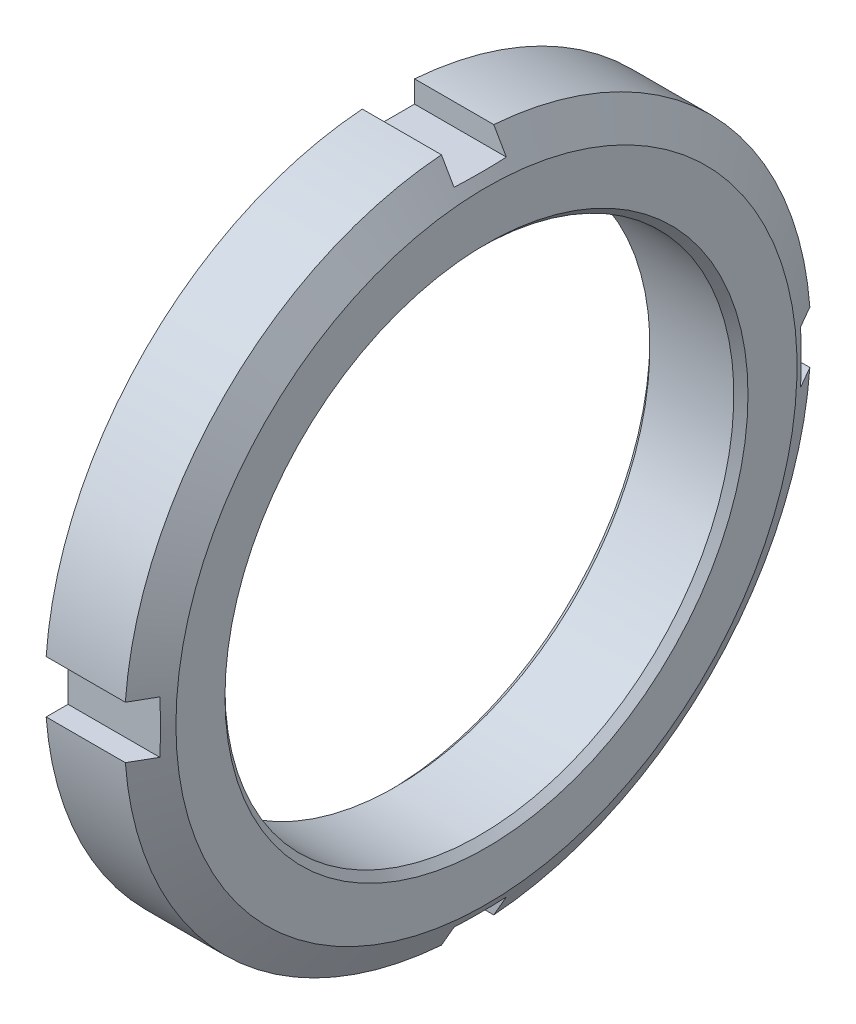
ISO-10303-21;
HEADER;
FILE_DESCRIPTION(('STEP AP214'),'2;1');
FILE_NAME('part.step','',(''),(''),'','','');
FILE_SCHEMA(('AUTOMOTIVE_DESIGN { 1 0 10303 214 1 1 1 1 }'));
ENDSEC;
DATA;
#1=APPLICATION_CONTEXT('core data for automotive mechanical design processes');
#2=APPLICATION_PROTOCOL_DEFINITION('international standard','automotive_design',2000,#1);
#3=PRODUCT_CONTEXT('',#1,'mechanical');
#4=PRODUCT('Part','Part','',(#3));
#5=PRODUCT_RELATED_PRODUCT_CATEGORY('part','',(#4));
#6=PRODUCT_DEFINITION_FORMATION('','',#4);
#7=PRODUCT_DEFINITION_CONTEXT('part definition',#1,'design');
#8=PRODUCT_DEFINITION('design','',#6,#7);
#9=PRODUCT_DEFINITION_SHAPE('','',#8);
#10=(LENGTH_UNIT() NAMED_UNIT(*) SI_UNIT(.MILLI.,.METRE.));
#11=(NAMED_UNIT(*) PLANE_ANGLE_UNIT() SI_UNIT($,.RADIAN.));
#12=(NAMED_UNIT(*) SI_UNIT($,.STERADIAN.) SOLID_ANGLE_UNIT());
#13=UNCERTAINTY_MEASURE_WITH_UNIT(LENGTH_MEASURE(1.E-05),#10,'distance_accuracy_value','');
#14=(GEOMETRIC_REPRESENTATION_CONTEXT(3) GLOBAL_UNCERTAINTY_ASSIGNED_CONTEXT((#13)) GLOBAL_UNIT_ASSIGNED_CONTEXT((#10,
#11,#12)) REPRESENTATION_CONTEXT('',''));
#15=CARTESIAN_POINT('',(0.,0.,0.));
#16=DIRECTION('',(0.,0.,1.));
#17=DIRECTION('',(1.,0.,0.));
#18=AXIS2_PLACEMENT_3D('',#15,#16,#17);
#19=CARTESIAN_POINT('',(15.,0.,0.));
#20=DIRECTION('',(-1.,0.,0.));
#21=DIRECTION('',(0.,0.,1.));
#22=AXIS2_PLACEMENT_3D('',#19,#20,#21);
#23=CYLINDRICAL_SURFACE('',#22,52.5);
#24=CARTESIAN_POINT('',(0.,0.,0.));
#25=DIRECTION('',(-1.,0.,0.));
#26=DIRECTION('',(0.,0.,1.));
#27=AXIS2_PLACEMENT_3D('',#24,#25,#26);
#28=CIRCLE('',#27,52.5);
#29=CARTESIAN_POINT('',(0.,4.,52.3473972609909));
#30=VERTEX_POINT('',#29);
#31=CARTESIAN_POINT('',(0.,52.3473972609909,4.));
#32=VERTEX_POINT('',#31);
#33=EDGE_CURVE('E251',#30,#32,#28,.T.);
#34=ORIENTED_EDGE('',*,*,#33,.F.);
#35=DIRECTION('',(-1.,0.,0.));
#36=VECTOR('',#35,1.);
#37=CARTESIAN_POINT('',(15.,4.,52.3473972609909));
#38=LINE('',#37,#36);
#39=CARTESIAN_POINT('',(12.113248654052,4.,52.3473972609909));
#40=VERTEX_POINT('',#39);
#41=EDGE_CURVE('E154',#30,#40,#38,.F.);
#42=ORIENTED_EDGE('',*,*,#41,.T.);
#43=CARTESIAN_POINT('',(12.113248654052,0.,0.));
#44=DIRECTION('',(-1.,0.,0.));
#45=DIRECTION('',(0.,0.,1.));
#46=AXIS2_PLACEMENT_3D('',#43,#44,#45);
#47=CIRCLE('',#46,52.5);
#48=CARTESIAN_POINT('',(12.113248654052,52.3473972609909,4.));
#49=VERTEX_POINT('',#48);
#50=EDGE_CURVE('E246',#40,#49,#47,.T.);
#51=ORIENTED_EDGE('',*,*,#50,.T.);
#52=DIRECTION('',(-1.,0.,0.));
#53=VECTOR('',#52,1.);
#54=CARTESIAN_POINT('',(15.,52.3473972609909,4.));
#55=LINE('',#54,#53);
#56=EDGE_CURVE('E167',#49,#32,#55,.T.);
#57=ORIENTED_EDGE('',*,*,#56,.T.);
#58=EDGE_LOOP('',(#34,#42,#51,#57));
#59=FACE_BOUND('',#58,.T.);
#60=ADVANCED_FACE('F31',(#59),#23,.T.);
#61=CARTESIAN_POINT('',(12.113248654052,-52.3473972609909,4.));
#62=VERTEX_POINT('',#61);
#63=CARTESIAN_POINT('',(12.113248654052,-4.,52.3473972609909));
#64=VERTEX_POINT('',#63);
#65=EDGE_CURVE('E245',#62,#64,#47,.T.);
#66=ORIENTED_EDGE('',*,*,#65,.T.);
#67=DIRECTION('',(-1.,0.,0.));
#68=VECTOR('',#67,1.);
#69=CARTESIAN_POINT('',(15.,-4.,52.3473972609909));
#70=LINE('',#69,#68);
#71=CARTESIAN_POINT('',(0.,-4.,52.3473972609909));
#72=VERTEX_POINT('',#71);
#73=EDGE_CURVE('E51',#64,#72,#70,.T.);
#74=ORIENTED_EDGE('',*,*,#73,.T.);
#75=CARTESIAN_POINT('',(0.,-52.3473972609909,4.));
#76=VERTEX_POINT('',#75);
#77=EDGE_CURVE('E249',#76,#72,#28,.T.);
#78=ORIENTED_EDGE('',*,*,#77,.F.);
#79=DIRECTION('',(-1.,0.,0.));
#80=VECTOR('',#79,1.);
#81=CARTESIAN_POINT('',(15.,-52.3473972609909,4.));
#82=LINE('',#81,#80);
#83=EDGE_CURVE('E225',#76,#62,#82,.F.);
#84=ORIENTED_EDGE('',*,*,#83,.T.);
#85=EDGE_LOOP('',(#66,#74,#78,#84));
#86=FACE_BOUND('',#85,.T.);
#87=ADVANCED_FACE('F371',(#86),#23,.T.);
#88=CARTESIAN_POINT('',(12.113248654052,-4.,-52.3473972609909));
#89=VERTEX_POINT('',#88);
#90=CARTESIAN_POINT('',(12.113248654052,-52.3473972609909,-4.));
#91=VERTEX_POINT('',#90);
#92=EDGE_CURVE('E373',#89,#91,#47,.T.);
#93=ORIENTED_EDGE('',*,*,#92,.T.);
#94=DIRECTION('',(-1.,0.,0.));
#95=VECTOR('',#94,1.);
#96=CARTESIAN_POINT('',(15.,-52.3473972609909,-4.));
#97=LINE('',#96,#95);
#98=CARTESIAN_POINT('',(0.,-52.3473972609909,-4.));
#99=VERTEX_POINT('',#98);
#100=EDGE_CURVE('E59',#91,#99,#97,.T.);
#101=ORIENTED_EDGE('',*,*,#100,.T.);
#102=CARTESIAN_POINT('',(0.,-4.,-52.3473972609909));
#103=VERTEX_POINT('',#102);
#104=EDGE_CURVE('E393',#103,#99,#28,.T.);
#105=ORIENTED_EDGE('',*,*,#104,.F.);
#106=DIRECTION('',(-1.,0.,0.));
#107=VECTOR('',#106,1.);
#108=CARTESIAN_POINT('',(15.,-4.,-52.3473972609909));
#109=LINE('',#108,#107);
#110=EDGE_CURVE('E221',#103,#89,#109,.F.);
#111=ORIENTED_EDGE('',*,*,#110,.T.);
#112=EDGE_LOOP('',(#93,#101,#105,#111));
#113=FACE_BOUND('',#112,.T.);
#114=ADVANCED_FACE('F402',(#113),#23,.T.);
#115=CARTESIAN_POINT('',(0.,0.,0.));
#116=DIRECTION('',(1.,0.,0.));
#117=DIRECTION('',(0.,0.,-1.));
#118=AXIS2_PLACEMENT_3D('',#115,#116,#117);
#119=PLANE('',#118);
#120=DIRECTION('',(0.,-1.,0.));
#121=VECTOR('',#120,1.);
#122=CARTESIAN_POINT('',(0.,4.,49.));
#123=LINE('',#122,#121);
#124=CARTESIAN_POINT('',(0.,4.,49.));
#125=VERTEX_POINT('',#124);
#126=CARTESIAN_POINT('',(0.,-4.,49.));
#127=VERTEX_POINT('',#126);
#128=EDGE_CURVE('E159',#125,#127,#123,.T.);
#129=ORIENTED_EDGE('',*,*,#128,.F.);
#130=DIRECTION('',(0.,0.,-1.));
#131=VECTOR('',#130,1.);
#132=CARTESIAN_POINT('',(0.,4.,52.5));
#133=LINE('',#132,#131);
#134=EDGE_CURVE('E149',#30,#125,#133,.T.);
#135=ORIENTED_EDGE('',*,*,#134,.F.);
#136=ORIENTED_EDGE('',*,*,#33,.T.);
#137=DIRECTION('',(0.,1.,0.));
#138=VECTOR('',#137,1.);
#139=CARTESIAN_POINT('',(0.,49.,4.));
#140=LINE('',#139,#138);
#141=CARTESIAN_POINT('',(0.,49.,4.));
#142=VERTEX_POINT('',#141);
#143=EDGE_CURVE('E195',#142,#32,#140,.T.);
#144=ORIENTED_EDGE('',*,*,#143,.F.);
#145=DIRECTION('',(0.,0.,1.));
#146=VECTOR('',#145,1.);
#147=CARTESIAN_POINT('',(0.,49.,-4.));
#148=LINE('',#147,#146);
#149=CARTESIAN_POINT('',(0.,49.,-4.));
#150=VERTEX_POINT('',#149);
#151=EDGE_CURVE('E192',#150,#142,#148,.T.);
#152=ORIENTED_EDGE('',*,*,#151,.F.);
#153=DIRECTION('',(0.,-1.,0.));
#154=VECTOR('',#153,1.);
#155=CARTESIAN_POINT('',(0.,52.5,-4.));
#156=LINE('',#155,#154);
#157=CARTESIAN_POINT('',(0.,52.3473972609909,-4.));
#158=VERTEX_POINT('',#157);
#159=EDGE_CURVE('E190',#158,#150,#156,.T.);
#160=ORIENTED_EDGE('',*,*,#159,.F.);
#161=CARTESIAN_POINT('',(0.,4.,-52.3473972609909));
#162=VERTEX_POINT('',#161);
#163=EDGE_CURVE('E254',#158,#162,#28,.T.);
#164=ORIENTED_EDGE('',*,*,#163,.T.);
#165=DIRECTION('',(0.,0.,-1.));
#166=VECTOR('',#165,1.);
#167=CARTESIAN_POINT('',(0.,4.,-49.));
#168=LINE('',#167,#166);
#169=CARTESIAN_POINT('',(0.,4.,-49.));
#170=VERTEX_POINT('',#169);
#171=EDGE_CURVE('E188',#170,#162,#168,.T.);
#172=ORIENTED_EDGE('',*,*,#171,.F.);
#173=DIRECTION('',(0.,1.,0.));
#174=VECTOR('',#173,1.);
#175=CARTESIAN_POINT('',(0.,-4.,-49.));
#176=LINE('',#175,#174);
#177=CARTESIAN_POINT('',(0.,-4.,-49.));
#178=VERTEX_POINT('',#177);
#179=EDGE_CURVE('E185',#178,#170,#176,.T.);
#180=ORIENTED_EDGE('',*,*,#179,.F.);
#181=DIRECTION('',(0.,0.,1.));
#182=VECTOR('',#181,1.);
#183=CARTESIAN_POINT('',(0.,-4.,-52.5));
#184=LINE('',#183,#182);
#185=EDGE_CURVE('E183',#103,#178,#184,.T.);
#186=ORIENTED_EDGE('',*,*,#185,.F.);
#187=ORIENTED_EDGE('',*,*,#104,.T.);
#188=DIRECTION('',(0.,-1.,0.));
#189=VECTOR('',#188,1.);
#190=CARTESIAN_POINT('',(0.,-49.,-4.));
#191=LINE('',#190,#189);
#192=CARTESIAN_POINT('',(0.,-49.,-4.));
#193=VERTEX_POINT('',#192);
#194=EDGE_CURVE('E181',#193,#99,#191,.T.);
#195=ORIENTED_EDGE('',*,*,#194,.F.);
#196=DIRECTION('',(0.,0.,-1.));
#197=VECTOR('',#196,1.);
#198=CARTESIAN_POINT('',(0.,-49.,4.));
#199=LINE('',#198,#197);
#200=CARTESIAN_POINT('',(0.,-49.,4.));
#201=VERTEX_POINT('',#200);
#202=EDGE_CURVE('E178',#201,#193,#199,.T.);
#203=ORIENTED_EDGE('',*,*,#202,.F.);
#204=DIRECTION('',(0.,1.,0.));
#205=VECTOR('',#204,1.);
#206=CARTESIAN_POINT('',(0.,-52.5,4.));
#207=LINE('',#206,#205);
#208=EDGE_CURVE('E174',#76,#201,#207,.T.);
#209=ORIENTED_EDGE('',*,*,#208,.F.);
#210=ORIENTED_EDGE('',*,*,#77,.T.);
#211=DIRECTION('',(0.,0.,1.));
#212=VECTOR('',#211,1.);
#213=CARTESIAN_POINT('',(0.,-4.,49.));
#214=LINE('',#213,#212);
#215=EDGE_CURVE('E172',#127,#72,#214,.T.);
#216=ORIENTED_EDGE('',*,*,#215,.F.);
#217=EDGE_LOOP('',(#129,#135,#136,#144,#152,#160,#164,#172,#180,#186,#187,#195,#203,#209,#210,#216));
#218=FACE_BOUND('',#217,.T.);
#219=CARTESIAN_POINT('',(0.,0.,0.));
#220=DIRECTION('',(-1.,0.,0.));
#221=DIRECTION('',(0.,0.,1.));
#222=AXIS2_PLACEMENT_3D('',#219,#220,#221);
#223=CIRCLE('',#222,40.);
#224=CARTESIAN_POINT('',(0.,0.,40.));
#225=VERTEX_POINT('',#224);
#226=EDGE_CURVE('E239',#225,#225,#223,.T.);
#227=ORIENTED_EDGE('',*,*,#226,.F.);
#228=EDGE_LOOP('',(#227));
#229=FACE_BOUND('',#228,.T.);
#230=ADVANCED_FACE('F33',(#218,#229),#119,.F.);
#231=CARTESIAN_POINT('',(15.,47.5,0.));
#232=DIRECTION('',(-1.,0.,0.));
#233=DIRECTION('',(0.,0.,1.));
#234=AXIS2_PLACEMENT_3D('',#231,#232,#233);
#235=PLANE('',#234);
#236=CARTESIAN_POINT('',(15.,0.,0.));
#237=DIRECTION('',(-1.,0.,0.));
#238=DIRECTION('',(0.,0.,1.));
#239=AXIS2_PLACEMENT_3D('',#236,#237,#238);
#240=CIRCLE('',#239,47.5);
#241=CARTESIAN_POINT('',(15.,0.,47.5));
#242=VERTEX_POINT('',#241);
#243=EDGE_CURVE('E242',#242,#242,#240,.T.);
#244=ORIENTED_EDGE('',*,*,#243,.F.);
#245=EDGE_LOOP('',(#244));
#246=FACE_BOUND('',#245,.T.);
#247=CARTESIAN_POINT('',(15.,0.,0.));
#248=DIRECTION('',(-1.,0.,0.));
#249=DIRECTION('',(0.,0.,1.));
#250=AXIS2_PLACEMENT_3D('',#247,#248,#249);
#251=CIRCLE('',#250,40.);
#252=CARTESIAN_POINT('',(15.,0.,40.));
#253=VERTEX_POINT('',#252);
#254=EDGE_CURVE('E230',#253,#253,#251,.T.);
#255=ORIENTED_EDGE('',*,*,#254,.T.);
#256=EDGE_LOOP('',(#255));
#257=FACE_BOUND('',#256,.T.);
#258=ADVANCED_FACE('F408',(#246,#257),#235,.F.);
#259=CARTESIAN_POINT('',(12.113248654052,52.3473972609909,-4.));
#260=VERTEX_POINT('',#259);
#261=CARTESIAN_POINT('',(12.113248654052,4.,-52.3473972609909));
#262=VERTEX_POINT('',#261);
#263=EDGE_CURVE('E250',#260,#262,#47,.T.);
#264=ORIENTED_EDGE('',*,*,#263,.T.);
#265=DIRECTION('',(-1.,0.,0.));
#266=VECTOR('',#265,1.);
#267=CARTESIAN_POINT('',(15.,4.,-52.3473972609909));
#268=LINE('',#267,#266);
#269=EDGE_CURVE('E218',#262,#162,#268,.T.);
#270=ORIENTED_EDGE('',*,*,#269,.T.);
#271=ORIENTED_EDGE('',*,*,#163,.F.);
#272=DIRECTION('',(-1.,0.,0.));
#273=VECTOR('',#272,1.);
#274=CARTESIAN_POINT('',(15.,52.3473972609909,-4.));
#275=LINE('',#274,#273);
#276=EDGE_CURVE('E215',#158,#260,#275,.F.);
#277=ORIENTED_EDGE('',*,*,#276,.T.);
#278=EDGE_LOOP('',(#264,#270,#271,#277));
#279=FACE_BOUND('',#278,.T.);
#280=ADVANCED_FACE('F380',(#279),#23,.T.);
#281=CARTESIAN_POINT('',(15.,0.,0.));
#282=DIRECTION('',(-1.,0.,0.));
#283=DIRECTION('',(0.,0.,1.));
#284=AXIS2_PLACEMENT_3D('',#281,#282,#283);
#285=CONICAL_SURFACE('',#284,47.5,1.04719755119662);
#286=ORIENTED_EDGE('',*,*,#50,.F.);
#287=CARTESIAN_POINT('',(9.40618773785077,4.,57.0487079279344));
#288=CARTESIAN_POINT('',(10.1121379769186,4.,55.8229603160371));
#289=CARTESIAN_POINT('',(10.818008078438,4.,54.5971665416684));
#290=CARTESIAN_POINT('',(12.2295432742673,4.,52.1454610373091));
#291=CARTESIAN_POINT('',(12.9352083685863,4.,50.9195493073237));
#292=CARTESIAN_POINT('',(14.3462888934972,4.,48.4675821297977));
#293=CARTESIAN_POINT('',(15.0517043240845,4.,47.2415266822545));
#294=CARTESIAN_POINT('',(16.4622154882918,4.,44.7892318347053));
#295=CARTESIAN_POINT('',(17.1673112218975,4.,43.562992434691));
#296=CARTESIAN_POINT('',(17.8722120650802,4.,42.3366409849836));
#297=B_SPLINE_CURVE_WITH_KNOTS('',3,(#287,#288,#289,#290,#291,#292,#293,#294,#295,#296),
.UNSPECIFIED.,.F.,.F.,(4,2,2,2,4),(0.,4.24351347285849,8.48702675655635,12.7305401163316,
16.9740536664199),.UNSPECIFIED.);
#298=CARTESIAN_POINT('',(14.0398698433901,4.,49.));
#299=VERTEX_POINT('',#298);
#300=EDGE_CURVE('E11',#40,#299,#297,.T.);
#301=ORIENTED_EDGE('',*,*,#300,.T.);
#302=CARTESIAN_POINT('',(13.0282591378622,13.8330417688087,49.));
#303=CARTESIAN_POINT('',(13.1379348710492,13.1339317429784,49.));
#304=CARTESIAN_POINT('',(13.2400718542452,12.4336244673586,49.));
#305=CARTESIAN_POINT('',(13.4286469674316,11.0308693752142,49.));
#306=CARTESIAN_POINT('',(13.5150843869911,10.3284214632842,49.));
#307=CARTESIAN_POINT('',(13.6716459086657,8.92155026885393,49.));
#308=CARTESIAN_POINT('',(13.7417664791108,8.21712659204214,49.));
#309=CARTESIAN_POINT('',(13.8651524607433,6.806811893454,49.));
#310=CARTESIAN_POINT('',(13.9184181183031,6.1009208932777,49.));
#311=CARTESIAN_POINT('',(14.0072810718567,4.69440893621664,49.));
#312=CARTESIAN_POINT('',(14.0430331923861,3.99379778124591,49.));
#313=CARTESIAN_POINT('',(14.0973027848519,2.59188666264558,49.));
#314=CARTESIAN_POINT('',(14.1158197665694,1.89058667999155,49.));
#315=CARTESIAN_POINT('',(14.1354682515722,0.487858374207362,49.));
#316=CARTESIAN_POINT('',(14.1366026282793,-0.213569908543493,49.));
#317=CARTESIAN_POINT('',(14.1214845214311,-1.6162599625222,49.));
#318=CARTESIAN_POINT('',(14.1052314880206,-2.31752172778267,49.));
#319=CARTESIAN_POINT('',(14.0554833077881,-3.7189210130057,49.));
#320=CARTESIAN_POINT('',(14.0220007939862,-4.41905898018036,49.));
#321=CARTESIAN_POINT('',(13.938068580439,-5.81832415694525,49.));
#322=CARTESIAN_POINT('',(13.8876183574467,-6.51745133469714,49.));
#323=CARTESIAN_POINT('',(13.7113418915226,-8.61292245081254,49.));
#324=CARTESIAN_POINT('',(13.560594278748,-10.0072344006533,49.));
#325=CARTESIAN_POINT('',(13.1952672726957,-12.8003493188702,49.));
#326=CARTESIAN_POINT('',(12.9801167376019,-14.1990767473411,49.));
#327=CARTESIAN_POINT('',(12.6142003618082,-16.2892017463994,49.));
#328=CARTESIAN_POINT('',(12.4850556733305,-16.9844637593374,49.));
#329=CARTESIAN_POINT('',(12.2131319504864,-18.3722787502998,49.));
#330=CARTESIAN_POINT('',(12.0703536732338,-19.0648318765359,49.));
#331=CARTESIAN_POINT('',(11.9211346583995,-19.7560016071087,49.));
#332=B_SPLINE_CURVE_WITH_KNOTS('',3,(#302,#303,#304,#305,#306,#307,#308,#309,#310,#311,#312,
#313,#314,#315,#316,#317,#318,#319,#320,#321,#322,#323,#324,#325,#326,#327,#328,#329,#330,#331),
.UNSPECIFIED.,.F.,.F.,(4,2,2,2,2,2,2,2,2,2,2,2,2,2,4),(0.,2.12296217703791,4.24602039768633,
6.36953771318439,8.49302398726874,10.5973831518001,12.7018021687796,14.805873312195,
16.9100109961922,19.0126080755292,21.1152700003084,25.3209584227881,29.5651083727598,
31.686455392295,33.8076846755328),.UNSPECIFIED.);
#333=CARTESIAN_POINT('',(14.0398698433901,-4.,49.));
#334=VERTEX_POINT('',#333);
#335=EDGE_CURVE('E44',#299,#334,#332,.T.);
#336=ORIENTED_EDGE('',*,*,#335,.T.);
#337=CARTESIAN_POINT('',(17.8722120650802,-4.,42.3366409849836));
#338=CARTESIAN_POINT('',(17.1673112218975,-4.,43.562992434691));
#339=CARTESIAN_POINT('',(16.4622154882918,-4.,44.7892318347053));
#340=CARTESIAN_POINT('',(15.0517043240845,-4.,47.2415266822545));
#341=CARTESIAN_POINT('',(14.3462888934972,-4.,48.4675821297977));
#342=CARTESIAN_POINT('',(12.9352083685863,-4.,50.9195493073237));
#343=CARTESIAN_POINT('',(12.2295432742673,-4.,52.1454610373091));
#344=CARTESIAN_POINT('',(10.818008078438,-4.,54.5971665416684));
#345=CARTESIAN_POINT('',(10.1121379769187,-4.,55.8229603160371));
#346=CARTESIAN_POINT('',(9.40618773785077,-4.,57.0487079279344));
#347=B_SPLINE_CURVE_WITH_KNOTS('',3,(#337,#338,#339,#340,#341,#342,#343,#344,#345,#346),
.UNSPECIFIED.,.F.,.F.,(4,2,2,2,4),(0.,4.24351355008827,8.48702690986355,12.7305401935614,
16.9740536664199),.UNSPECIFIED.);
#348=EDGE_CURVE('E345',#334,#64,#347,.T.);
#349=ORIENTED_EDGE('',*,*,#348,.T.);
#350=ORIENTED_EDGE('',*,*,#65,.F.);
#351=CARTESIAN_POINT('',(8.09096465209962,-59.3321188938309,4.));
#352=CARTESIAN_POINT('',(8.79701310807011,-58.1064278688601,4.));
#353=CARTESIAN_POINT('',(9.50299005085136,-56.8806956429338,4.));
#354=CARTESIAN_POINT('',(10.914763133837,-54.4291271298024,4.));
#355=CARTESIAN_POINT('',(11.6205592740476,-53.2032908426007,4.));
#356=CARTESIAN_POINT('',(13.0319330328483,-50.7514924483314,4.));
#357=CARTESIAN_POINT('',(13.7375106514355,-49.5255303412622,4.));
#358=CARTESIAN_POINT('',(15.1483894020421,-47.0734469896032,4.));
#359=CARTESIAN_POINT('',(15.853690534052,-45.8473257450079,4.));
#360=CARTESIAN_POINT('',(16.5588244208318,-44.6211083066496,4.));
#361=B_SPLINE_CURVE_WITH_KNOTS('',3,(#351,#352,#353,#354,#355,#356,#357,#358,#359,#360),
.UNSPECIFIED.,.F.,.F.,(4,2,2,2,4),(0.,4.24351343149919,8.48702671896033,12.7305400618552,
16.9740535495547),.UNSPECIFIED.);
#362=CARTESIAN_POINT('',(14.0398698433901,-49.,4.));
#363=VERTEX_POINT('',#362);
#364=EDGE_CURVE('E339',#62,#363,#361,.T.);
#365=ORIENTED_EDGE('',*,*,#364,.T.);
#366=CARTESIAN_POINT('',(13.0282591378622,-49.,13.8330417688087));
#367=CARTESIAN_POINT('',(13.1379348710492,-49.,13.1339317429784));
#368=CARTESIAN_POINT('',(13.2400718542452,-49.,12.4336244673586));
#369=CARTESIAN_POINT('',(13.4286469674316,-49.,11.0308693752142));
#370=CARTESIAN_POINT('',(13.5150843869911,-49.,10.3284214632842));
#371=CARTESIAN_POINT('',(13.6716459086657,-49.,8.92155026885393));
#372=CARTESIAN_POINT('',(13.7417664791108,-49.,8.21712659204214));
#373=CARTESIAN_POINT('',(13.8651524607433,-49.,6.806811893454));
#374=CARTESIAN_POINT('',(13.9184181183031,-49.,6.1009208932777));
#375=CARTESIAN_POINT('',(14.0072810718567,-49.,4.69440893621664));
#376=CARTESIAN_POINT('',(14.0430331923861,-49.,3.99379778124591));
#377=CARTESIAN_POINT('',(14.0973027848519,-49.,2.59188666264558));
#378=CARTESIAN_POINT('',(14.1158197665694,-49.,1.89058667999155));
#379=CARTESIAN_POINT('',(14.1354682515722,-49.,0.487858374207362));
#380=CARTESIAN_POINT('',(14.1366026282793,-49.,-0.213569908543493));
#381=CARTESIAN_POINT('',(14.1214845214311,-49.,-1.6162599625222));
#382=CARTESIAN_POINT('',(14.1052314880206,-49.,-2.31752172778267));
#383=CARTESIAN_POINT('',(14.0554833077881,-49.,-3.7189210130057));
#384=CARTESIAN_POINT('',(14.0220007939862,-49.,-4.41905898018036));
#385=CARTESIAN_POINT('',(13.938068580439,-49.,-5.81832415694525));
#386=CARTESIAN_POINT('',(13.8876183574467,-49.,-6.51745133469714));
#387=CARTESIAN_POINT('',(13.7113418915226,-49.,-8.61292245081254));
#388=CARTESIAN_POINT('',(13.560594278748,-49.,-10.0072344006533));
#389=CARTESIAN_POINT('',(13.1952672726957,-49.,-12.8003493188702));
#390=CARTESIAN_POINT('',(12.9801167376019,-49.,-14.1990767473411));
#391=CARTESIAN_POINT('',(12.6142003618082,-49.,-16.2892017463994));
#392=CARTESIAN_POINT('',(12.4850556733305,-49.,-16.9844637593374));
#393=CARTESIAN_POINT('',(12.2131319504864,-49.,-18.3722787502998));
#394=CARTESIAN_POINT('',(12.0703536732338,-49.,-19.0648318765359));
#395=CARTESIAN_POINT('',(11.9211346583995,-49.,-19.7560016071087));
#396=B_SPLINE_CURVE_WITH_KNOTS('',3,(#366,#367,#368,#369,#370,#371,#372,#373,#374,#375,#376,
#377,#378,#379,#380,#381,#382,#383,#384,#385,#386,#387,#388,#389,#390,#391,#392,#393,#394,#395),
.UNSPECIFIED.,.F.,.F.,(4,2,2,2,2,2,2,2,2,2,2,2,2,2,4),(0.,2.12296217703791,4.24602039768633,
6.36953771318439,8.49302398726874,10.5973831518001,12.7018021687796,14.805873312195,
16.9100109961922,19.0126080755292,21.1152700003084,25.3209584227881,29.5651083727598,
31.686455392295,33.8076846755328),.UNSPECIFIED.);
#397=CARTESIAN_POINT('',(14.0398698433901,-49.,-4.));
#398=VERTEX_POINT('',#397);
#399=EDGE_CURVE('E333',#363,#398,#396,.T.);
#400=ORIENTED_EDGE('',*,*,#399,.T.);
#401=CARTESIAN_POINT('',(16.5588244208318,-44.6211083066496,-4.));
#402=CARTESIAN_POINT('',(15.853690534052,-45.8473257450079,-4.));
#403=CARTESIAN_POINT('',(15.1483894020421,-47.0734469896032,-4.));
#404=CARTESIAN_POINT('',(13.7375106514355,-49.5255303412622,-4.));
#405=CARTESIAN_POINT('',(13.0319330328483,-50.7514924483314,-4.));
#406=CARTESIAN_POINT('',(11.6205592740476,-53.2032908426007,-4.));
#407=CARTESIAN_POINT('',(10.914763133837,-54.4291271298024,-4.));
#408=CARTESIAN_POINT('',(9.50299005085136,-56.8806956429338,-4.));
#409=CARTESIAN_POINT('',(8.79701310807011,-58.1064278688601,-4.));
#410=CARTESIAN_POINT('',(8.09096465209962,-59.3321188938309,-4.));
#411=B_SPLINE_CURVE_WITH_KNOTS('',3,(#401,#402,#403,#404,#405,#406,#407,#408,#409,#410),
.UNSPECIFIED.,.F.,.F.,(4,2,2,2,4),(0.,4.24351348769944,8.48702683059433,12.7305401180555,
16.9740535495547),.UNSPECIFIED.);
#412=EDGE_CURVE('E328',#398,#91,#411,.T.);
#413=ORIENTED_EDGE('',*,*,#412,.T.);
#414=ORIENTED_EDGE('',*,*,#92,.F.);
#415=CARTESIAN_POINT('',(8.09096465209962,-4.,-59.3321188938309));
#416=CARTESIAN_POINT('',(8.79701310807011,-4.,-58.1064278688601));
#417=CARTESIAN_POINT('',(9.50299005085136,-4.,-56.8806956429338));
#418=CARTESIAN_POINT('',(10.914763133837,-4.,-54.4291271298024));
#419=CARTESIAN_POINT('',(11.6205592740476,-4.,-53.2032908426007));
#420=CARTESIAN_POINT('',(13.0319330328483,-4.,-50.7514924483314));
#421=CARTESIAN_POINT('',(13.7375106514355,-4.,-49.5255303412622));
#422=CARTESIAN_POINT('',(15.1483894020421,-4.,-47.0734469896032));
#423=CARTESIAN_POINT('',(15.853690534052,-4.,-45.8473257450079));
#424=CARTESIAN_POINT('',(16.5588244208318,-4.,-44.6211083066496));
#425=B_SPLINE_CURVE_WITH_KNOTS('',3,(#415,#416,#417,#418,#419,#420,#421,#422,#423,#424),
.UNSPECIFIED.,.F.,.F.,(4,2,2,2,4),(0.,4.24351343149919,8.48702671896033,12.7305400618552,
16.9740535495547),.UNSPECIFIED.);
#426=CARTESIAN_POINT('',(14.0398698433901,-4.,-49.));
#427=VERTEX_POINT('',#426);
#428=EDGE_CURVE('E306',#89,#427,#425,.T.);
#429=ORIENTED_EDGE('',*,*,#428,.T.);
#430=CARTESIAN_POINT('',(11.9211346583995,-19.7560016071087,-49.));
#431=CARTESIAN_POINT('',(12.0703536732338,-19.0648318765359,-49.));
#432=CARTESIAN_POINT('',(12.2131319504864,-18.3722787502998,-49.));
#433=CARTESIAN_POINT('',(12.4850556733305,-16.9844637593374,-49.));
#434=CARTESIAN_POINT('',(12.6142003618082,-16.2892017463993,-49.));
#435=CARTESIAN_POINT('',(12.9801167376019,-14.1990767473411,-49.));
#436=CARTESIAN_POINT('',(13.1952672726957,-12.8003493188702,-49.));
#437=CARTESIAN_POINT('',(13.560594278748,-10.0072344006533,-49.));
#438=CARTESIAN_POINT('',(13.7113418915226,-8.61292245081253,-49.));
#439=CARTESIAN_POINT('',(13.8876183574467,-6.51745133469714,-49.));
#440=CARTESIAN_POINT('',(13.938068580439,-5.81832415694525,-49.));
#441=CARTESIAN_POINT('',(14.0220007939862,-4.41905898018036,-49.));
#442=CARTESIAN_POINT('',(14.0554833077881,-3.7189210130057,-49.));
#443=CARTESIAN_POINT('',(14.1052314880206,-2.31752172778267,-49.));
#444=CARTESIAN_POINT('',(14.1214845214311,-1.6162599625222,-49.));
#445=CARTESIAN_POINT('',(14.1366026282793,-0.213569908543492,-49.));
#446=CARTESIAN_POINT('',(14.1354682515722,0.487858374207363,-49.));
#447=CARTESIAN_POINT('',(14.1158197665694,1.89058667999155,-49.));
#448=CARTESIAN_POINT('',(14.0973027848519,2.59188666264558,-49.));
#449=CARTESIAN_POINT('',(14.0430331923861,3.99379778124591,-49.));
#450=CARTESIAN_POINT('',(14.0072810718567,4.69440893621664,-49.));
#451=CARTESIAN_POINT('',(13.9184181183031,6.1009208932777,-49.));
#452=CARTESIAN_POINT('',(13.8651524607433,6.806811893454,-49.));
#453=CARTESIAN_POINT('',(13.7417664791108,8.21712659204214,-49.));
#454=CARTESIAN_POINT('',(13.6716459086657,8.92155026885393,-49.));
#455=CARTESIAN_POINT('',(13.5150843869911,10.3284214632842,-49.));
#456=CARTESIAN_POINT('',(13.4286469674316,11.0308693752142,-49.));
#457=CARTESIAN_POINT('',(13.2400718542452,12.4336244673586,-49.));
#458=CARTESIAN_POINT('',(13.1379348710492,13.1339317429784,-49.));
#459=CARTESIAN_POINT('',(13.0282591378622,13.8330417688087,-49.));
#460=B_SPLINE_CURVE_WITH_KNOTS('',3,(#430,#431,#432,#433,#434,#435,#436,#437,#438,#439,#440,
#441,#442,#443,#444,#445,#446,#447,#448,#449,#450,#451,#452,#453,#454,#455,#456,#457,#458,#459),
.UNSPECIFIED.,.F.,.F.,(4,2,2,2,2,2,2,2,2,2,2,2,2,2,4),(0.,2.1212292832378,4.24257630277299,
8.48672625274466,12.6924146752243,14.7950766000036,16.8976736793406,19.0018113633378,
21.1058825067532,23.2103015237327,25.314660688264,27.4381469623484,29.5616642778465,
31.6847224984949,33.8076846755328),.UNSPECIFIED.);
#461=CARTESIAN_POINT('',(14.0398698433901,4.,-49.));
#462=VERTEX_POINT('',#461);
#463=EDGE_CURVE('E300',#427,#462,#460,.T.);
#464=ORIENTED_EDGE('',*,*,#463,.T.);
#465=CARTESIAN_POINT('',(16.5588244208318,4.,-44.6211083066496));
#466=CARTESIAN_POINT('',(15.853690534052,4.,-45.8473257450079));
#467=CARTESIAN_POINT('',(15.1483894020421,4.,-47.0734469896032));
#468=CARTESIAN_POINT('',(13.7375106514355,4.,-49.5255303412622));
#469=CARTESIAN_POINT('',(13.0319330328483,4.,-50.7514924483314));
#470=CARTESIAN_POINT('',(11.6205592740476,4.,-53.2032908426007));
#471=CARTESIAN_POINT('',(10.914763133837,4.,-54.4291271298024));
#472=CARTESIAN_POINT('',(9.50299005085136,4.,-56.8806956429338));
#473=CARTESIAN_POINT('',(8.79701310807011,4.,-58.1064278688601));
#474=CARTESIAN_POINT('',(8.09096465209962,4.,-59.3321188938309));
#475=B_SPLINE_CURVE_WITH_KNOTS('',3,(#465,#466,#467,#468,#469,#470,#471,#472,#473,#474),
.UNSPECIFIED.,.F.,.F.,(4,2,2,2,4),(0.,4.24351348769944,8.48702683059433,12.7305401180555,
16.9740535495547),.UNSPECIFIED.);
#476=EDGE_CURVE('E294',#462,#262,#475,.T.);
#477=ORIENTED_EDGE('',*,*,#476,.T.);
#478=ORIENTED_EDGE('',*,*,#263,.F.);
#479=CARTESIAN_POINT('',(9.40618773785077,57.0487079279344,-4.));
#480=CARTESIAN_POINT('',(10.1121379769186,55.8229603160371,-4.));
#481=CARTESIAN_POINT('',(10.818008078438,54.5971665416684,-4.));
#482=CARTESIAN_POINT('',(12.2295432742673,52.1454610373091,-4.));
#483=CARTESIAN_POINT('',(12.9352083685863,50.9195493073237,-4.));
#484=CARTESIAN_POINT('',(14.3462888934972,48.4675821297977,-4.));
#485=CARTESIAN_POINT('',(15.0517043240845,47.2415266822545,-4.));
#486=CARTESIAN_POINT('',(16.4622154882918,44.7892318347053,-4.));
#487=CARTESIAN_POINT('',(17.1673112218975,43.562992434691,-4.));
#488=CARTESIAN_POINT('',(17.8722120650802,42.3366409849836,-4.));
#489=B_SPLINE_CURVE_WITH_KNOTS('',3,(#479,#480,#481,#482,#483,#484,#485,#486,#487,#488),
.UNSPECIFIED.,.F.,.F.,(4,2,2,2,4),(0.,4.24351347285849,8.48702675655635,12.7305401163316,
16.9740536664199),.UNSPECIFIED.);
#490=CARTESIAN_POINT('',(14.0398698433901,49.,-4.));
#491=VERTEX_POINT('',#490);
#492=EDGE_CURVE('E288',#260,#491,#489,.T.);
#493=ORIENTED_EDGE('',*,*,#492,.T.);
#494=CARTESIAN_POINT('',(11.9211346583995,49.,-19.7560016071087));
#495=CARTESIAN_POINT('',(12.0703536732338,49.,-19.0648318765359));
#496=CARTESIAN_POINT('',(12.2131319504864,49.,-18.3722787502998));
#497=CARTESIAN_POINT('',(12.4850556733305,49.,-16.9844637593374));
#498=CARTESIAN_POINT('',(12.6142003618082,49.,-16.2892017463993));
#499=CARTESIAN_POINT('',(12.9801167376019,49.,-14.1990767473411));
#500=CARTESIAN_POINT('',(13.1952672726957,49.,-12.8003493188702));
#501=CARTESIAN_POINT('',(13.560594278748,49.,-10.0072344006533));
#502=CARTESIAN_POINT('',(13.7113418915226,49.,-8.61292245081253));
#503=CARTESIAN_POINT('',(13.8876183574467,49.,-6.51745133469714));
#504=CARTESIAN_POINT('',(13.938068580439,49.,-5.81832415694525));
#505=CARTESIAN_POINT('',(14.0220007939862,49.,-4.41905898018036));
#506=CARTESIAN_POINT('',(14.0554833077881,49.,-3.7189210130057));
#507=CARTESIAN_POINT('',(14.1052314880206,49.,-2.31752172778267));
#508=CARTESIAN_POINT('',(14.1214845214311,49.,-1.6162599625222));
#509=CARTESIAN_POINT('',(14.1366026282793,49.,-0.213569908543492));
#510=CARTESIAN_POINT('',(14.1354682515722,49.,0.487858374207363));
#511=CARTESIAN_POINT('',(14.1158197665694,49.,1.89058667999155));
#512=CARTESIAN_POINT('',(14.0973027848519,49.,2.59188666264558));
#513=CARTESIAN_POINT('',(14.0430331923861,49.,3.99379778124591));
#514=CARTESIAN_POINT('',(14.0072810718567,49.,4.69440893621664));
#515=CARTESIAN_POINT('',(13.9184181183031,49.,6.1009208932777));
#516=CARTESIAN_POINT('',(13.8651524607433,49.,6.806811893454));
#517=CARTESIAN_POINT('',(13.7417664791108,49.,8.21712659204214));
#518=CARTESIAN_POINT('',(13.6716459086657,49.,8.92155026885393));
#519=CARTESIAN_POINT('',(13.5150843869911,49.,10.3284214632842));
#520=CARTESIAN_POINT('',(13.4286469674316,49.,11.0308693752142));
#521=CARTESIAN_POINT('',(13.2400718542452,49.,12.4336244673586));
#522=CARTESIAN_POINT('',(13.1379348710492,49.,13.1339317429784));
#523=CARTESIAN_POINT('',(13.0282591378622,49.,13.8330417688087));
#524=B_SPLINE_CURVE_WITH_KNOTS('',3,(#494,#495,#496,#497,#498,#499,#500,#501,#502,#503,#504,
#505,#506,#507,#508,#509,#510,#511,#512,#513,#514,#515,#516,#517,#518,#519,#520,#521,#522,#523),
.UNSPECIFIED.,.F.,.F.,(4,2,2,2,2,2,2,2,2,2,2,2,2,2,4),(0.,2.1212292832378,4.24257630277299,
8.48672625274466,12.6924146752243,14.7950766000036,16.8976736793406,19.0018113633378,
21.1058825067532,23.2103015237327,25.314660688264,27.4381469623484,29.5616642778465,
31.6847224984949,33.8076846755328),.UNSPECIFIED.);
#525=CARTESIAN_POINT('',(14.0398698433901,49.,4.));
#526=VERTEX_POINT('',#525);
#527=EDGE_CURVE('E261',#491,#526,#524,.T.);
#528=ORIENTED_EDGE('',*,*,#527,.T.);
#529=CARTESIAN_POINT('',(17.8722120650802,42.3366409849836,4.));
#530=CARTESIAN_POINT('',(17.1673112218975,43.562992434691,4.));
#531=CARTESIAN_POINT('',(16.4622154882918,44.7892318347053,4.));
#532=CARTESIAN_POINT('',(15.0517043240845,47.2415266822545,4.));
#533=CARTESIAN_POINT('',(14.3462888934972,48.4675821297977,4.));
#534=CARTESIAN_POINT('',(12.9352083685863,50.9195493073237,4.));
#535=CARTESIAN_POINT('',(12.2295432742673,52.1454610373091,4.));
#536=CARTESIAN_POINT('',(10.818008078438,54.5971665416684,4.));
#537=CARTESIAN_POINT('',(10.1121379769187,55.8229603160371,4.));
#538=CARTESIAN_POINT('',(9.40618773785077,57.0487079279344,4.));
#539=B_SPLINE_CURVE_WITH_KNOTS('',3,(#529,#530,#531,#532,#533,#534,#535,#536,#537,#538),
.UNSPECIFIED.,.F.,.F.,(4,2,2,2,4),(0.,4.24351355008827,8.48702690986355,12.7305401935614,
16.9740536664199),.UNSPECIFIED.);
#540=EDGE_CURVE('E253',#526,#49,#539,.T.);
#541=ORIENTED_EDGE('',*,*,#540,.T.);
#542=EDGE_LOOP('',(#286,#301,#336,#349,#350,#365,#400,#413,#414,#429,#464,#477,#478,#493,#528,#541));
#543=FACE_BOUND('',#542,.T.);
#544=ORIENTED_EDGE('',*,*,#243,.T.);
#545=EDGE_LOOP('',(#544));
#546=FACE_BOUND('',#545,.T.);
#547=ADVANCED_FACE('F267',(#543,#546),#285,.T.);
#548=CARTESIAN_POINT('',(1.0825,0.,0.));
#549=DIRECTION('',(-1.,0.,0.));
#550=DIRECTION('',(0.,0.,1.));
#551=AXIS2_PLACEMENT_3D('',#548,#549,#550);
#552=CONICAL_SURFACE('',#551,38.9175,0.785398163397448);
#553=ORIENTED_EDGE('',*,*,#226,.T.);
#554=EDGE_LOOP('',(#553));
#555=FACE_BOUND('',#554,.T.);
#556=CARTESIAN_POINT('',(1.0825,0.,0.));
#557=DIRECTION('',(-1.,0.,0.));
#558=DIRECTION('',(0.,0.,1.));
#559=AXIS2_PLACEMENT_3D('',#556,#557,#558);
#560=CIRCLE('',#559,38.9175);
#561=CARTESIAN_POINT('',(1.0825,0.,38.9175));
#562=VERTEX_POINT('',#561);
#563=EDGE_CURVE('E236',#562,#562,#560,.T.);
#564=ORIENTED_EDGE('',*,*,#563,.F.);
#565=EDGE_LOOP('',(#564));
#566=FACE_BOUND('',#565,.T.);
#567=ADVANCED_FACE('F451',(#555,#566),#552,.F.);
#568=CARTESIAN_POINT('',(15.,0.,0.));
#569=DIRECTION('',(-1.,0.,0.));
#570=DIRECTION('',(0.,0.,1.));
#571=AXIS2_PLACEMENT_3D('',#568,#569,#570);
#572=CYLINDRICAL_SURFACE('',#571,38.9175);
#573=ORIENTED_EDGE('',*,*,#563,.T.);
#574=EDGE_LOOP('',(#573));
#575=FACE_BOUND('',#574,.T.);
#576=CARTESIAN_POINT('',(13.9175,0.,0.));
#577=DIRECTION('',(-1.,0.,0.));
#578=DIRECTION('',(0.,0.,1.));
#579=AXIS2_PLACEMENT_3D('',#576,#577,#578);
#580=CIRCLE('',#579,38.9175);
#581=CARTESIAN_POINT('',(13.9175,0.,38.9175));
#582=VERTEX_POINT('',#581);
#583=EDGE_CURVE('E233',#582,#582,#580,.T.);
#584=ORIENTED_EDGE('',*,*,#583,.F.);
#585=EDGE_LOOP('',(#584));
#586=FACE_BOUND('',#585,.T.);
#587=ADVANCED_FACE('F533',(#575,#586),#572,.F.);
#588=CARTESIAN_POINT('',(15.,0.,0.));
#589=DIRECTION('',(1.,0.,0.));
#590=DIRECTION('',(0.,0.,-1.));
#591=AXIS2_PLACEMENT_3D('',#588,#589,#590);
#592=CONICAL_SURFACE('',#591,40.,0.785398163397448);
#593=ORIENTED_EDGE('',*,*,#583,.T.);
#594=EDGE_LOOP('',(#593));
#595=FACE_BOUND('',#594,.T.);
#596=ORIENTED_EDGE('',*,*,#254,.F.);
#597=EDGE_LOOP('',(#596));
#598=FACE_BOUND('',#597,.T.);
#599=ADVANCED_FACE('F274',(#595,#598),#592,.F.);
#600=CARTESIAN_POINT('',(15.,49.,4.));
#601=DIRECTION('',(0.,0.,1.));
#602=DIRECTION('',(1.,0.,0.));
#603=AXIS2_PLACEMENT_3D('',#600,#601,#602);
#604=PLANE('',#603);
#605=ORIENTED_EDGE('',*,*,#540,.F.);
#606=DIRECTION('',(-1.,0.,0.));
#607=VECTOR('',#606,1.);
#608=CARTESIAN_POINT('',(15.,49.,4.));
#609=LINE('',#608,#607);
#610=EDGE_CURVE('E197',#526,#142,#609,.T.);
#611=ORIENTED_EDGE('',*,*,#610,.T.);
#612=ORIENTED_EDGE('',*,*,#143,.T.);
#613=ORIENTED_EDGE('',*,*,#56,.F.);
#614=EDGE_LOOP('',(#605,#611,#612,#613));
#615=FACE_BOUND('',#614,.T.);
#616=ADVANCED_FACE('F270',(#615),#604,.F.);
#617=CARTESIAN_POINT('',(15.,49.,-4.));
#618=DIRECTION('',(0.,-1.,0.));
#619=DIRECTION('',(0.,0.,-1.));
#620=AXIS2_PLACEMENT_3D('',#617,#618,#619);
#621=PLANE('',#620);
#622=DIRECTION('',(-1.,0.,0.));
#623=VECTOR('',#622,1.);
#624=CARTESIAN_POINT('',(15.,49.,-4.));
#625=LINE('',#624,#623);
#626=EDGE_CURVE('E199',#491,#150,#625,.T.);
#627=ORIENTED_EDGE('',*,*,#626,.T.);
#628=ORIENTED_EDGE('',*,*,#151,.T.);
#629=ORIENTED_EDGE('',*,*,#610,.F.);
#630=ORIENTED_EDGE('',*,*,#527,.F.);
#631=EDGE_LOOP('',(#627,#628,#629,#630));
#632=FACE_BOUND('',#631,.T.);
#633=ADVANCED_FACE('F273',(#632),#621,.F.);
#634=CARTESIAN_POINT('',(15.,52.5,-4.));
#635=DIRECTION('',(0.,0.,-1.));
#636=DIRECTION('',(-1.,0.,0.));
#637=AXIS2_PLACEMENT_3D('',#634,#635,#636);
#638=PLANE('',#637);
#639=ORIENTED_EDGE('',*,*,#159,.T.);
#640=ORIENTED_EDGE('',*,*,#626,.F.);
#641=ORIENTED_EDGE('',*,*,#492,.F.);
#642=ORIENTED_EDGE('',*,*,#276,.F.);
#643=EDGE_LOOP('',(#639,#640,#641,#642));
#644=FACE_BOUND('',#643,.T.);
#645=ADVANCED_FACE('F279',(#644),#638,.F.);
#646=CARTESIAN_POINT('',(15.,4.,-49.));
#647=DIRECTION('',(0.,1.,0.));
#648=DIRECTION('',(0.,0.,1.));
#649=AXIS2_PLACEMENT_3D('',#646,#647,#648);
#650=PLANE('',#649);
#651=ORIENTED_EDGE('',*,*,#476,.F.);
#652=DIRECTION('',(-1.,0.,0.));
#653=VECTOR('',#652,1.);
#654=CARTESIAN_POINT('',(15.,4.,-49.));
#655=LINE('',#654,#653);
#656=EDGE_CURVE('E202',#462,#170,#655,.T.);
#657=ORIENTED_EDGE('',*,*,#656,.T.);
#658=ORIENTED_EDGE('',*,*,#171,.T.);
#659=ORIENTED_EDGE('',*,*,#269,.F.);
#660=EDGE_LOOP('',(#651,#657,#658,#659));
#661=FACE_BOUND('',#660,.T.);
#662=ADVANCED_FACE('F284',(#661),#650,.F.);
#663=CARTESIAN_POINT('',(15.,-4.,-49.));
#664=DIRECTION('',(0.,0.,1.));
#665=DIRECTION('',(1.,0.,0.));
#666=AXIS2_PLACEMENT_3D('',#663,#664,#665);
#667=PLANE('',#666);
#668=DIRECTION('',(-1.,0.,0.));
#669=VECTOR('',#668,1.);
#670=CARTESIAN_POINT('',(15.,-4.,-49.));
#671=LINE('',#670,#669);
#672=EDGE_CURVE('E204',#427,#178,#671,.T.);
#673=ORIENTED_EDGE('',*,*,#672,.T.);
#674=ORIENTED_EDGE('',*,*,#179,.T.);
#675=ORIENTED_EDGE('',*,*,#656,.F.);
#676=ORIENTED_EDGE('',*,*,#463,.F.);
#677=EDGE_LOOP('',(#673,#674,#675,#676));
#678=FACE_BOUND('',#677,.T.);
#679=ADVANCED_FACE('F312',(#678),#667,.F.);
#680=CARTESIAN_POINT('',(15.,-4.,-52.5));
#681=DIRECTION('',(0.,-1.,0.));
#682=DIRECTION('',(0.,0.,-1.));
#683=AXIS2_PLACEMENT_3D('',#680,#681,#682);
#684=PLANE('',#683);
#685=ORIENTED_EDGE('',*,*,#185,.T.);
#686=ORIENTED_EDGE('',*,*,#672,.F.);
#687=ORIENTED_EDGE('',*,*,#428,.F.);
#688=ORIENTED_EDGE('',*,*,#110,.F.);
#689=EDGE_LOOP('',(#685,#686,#687,#688));
#690=FACE_BOUND('',#689,.T.);
#691=ADVANCED_FACE('F315',(#690),#684,.F.);
#692=CARTESIAN_POINT('',(15.,-49.,-4.));
#693=DIRECTION('',(0.,0.,-1.));
#694=DIRECTION('',(-1.,0.,0.));
#695=AXIS2_PLACEMENT_3D('',#692,#693,#694);
#696=PLANE('',#695);
#697=ORIENTED_EDGE('',*,*,#412,.F.);
#698=DIRECTION('',(-1.,0.,0.));
#699=VECTOR('',#698,1.);
#700=CARTESIAN_POINT('',(15.,-49.,-4.));
#701=LINE('',#700,#699);
#702=EDGE_CURVE('E207',#398,#193,#701,.T.);
#703=ORIENTED_EDGE('',*,*,#702,.T.);
#704=ORIENTED_EDGE('',*,*,#194,.T.);
#705=ORIENTED_EDGE('',*,*,#100,.F.);
#706=EDGE_LOOP('',(#697,#703,#704,#705));
#707=FACE_BOUND('',#706,.T.);
#708=ADVANCED_FACE('F320',(#707),#696,.F.);
#709=CARTESIAN_POINT('',(15.,-49.,4.));
#710=DIRECTION('',(0.,1.,0.));
#711=DIRECTION('',(0.,0.,1.));
#712=AXIS2_PLACEMENT_3D('',#709,#710,#711);
#713=PLANE('',#712);
#714=DIRECTION('',(-1.,0.,0.));
#715=VECTOR('',#714,1.);
#716=CARTESIAN_POINT('',(15.,-49.,4.));
#717=LINE('',#716,#715);
#718=EDGE_CURVE('E209',#363,#201,#717,.T.);
#719=ORIENTED_EDGE('',*,*,#718,.T.);
#720=ORIENTED_EDGE('',*,*,#202,.T.);
#721=ORIENTED_EDGE('',*,*,#702,.F.);
#722=ORIENTED_EDGE('',*,*,#399,.F.);
#723=EDGE_LOOP('',(#719,#720,#721,#722));
#724=FACE_BOUND('',#723,.T.);
#725=ADVANCED_FACE('F325',(#724),#713,.F.);
#726=CARTESIAN_POINT('',(15.,-52.5,4.));
#727=DIRECTION('',(0.,0.,1.));
#728=DIRECTION('',(1.,0.,0.));
#729=AXIS2_PLACEMENT_3D('',#726,#727,#728);
#730=PLANE('',#729);
#731=ORIENTED_EDGE('',*,*,#208,.T.);
#732=ORIENTED_EDGE('',*,*,#718,.F.);
#733=ORIENTED_EDGE('',*,*,#364,.F.);
#734=ORIENTED_EDGE('',*,*,#83,.F.);
#735=EDGE_LOOP('',(#731,#732,#733,#734));
#736=FACE_BOUND('',#735,.T.);
#737=ADVANCED_FACE('F350',(#736),#730,.F.);
#738=CARTESIAN_POINT('',(15.,4.,52.5));
#739=DIRECTION('',(0.,1.,0.));
#740=DIRECTION('',(0.,0.,1.));
#741=AXIS2_PLACEMENT_3D('',#738,#739,#740);
#742=PLANE('',#741);
#743=ORIENTED_EDGE('',*,*,#134,.T.);
#744=DIRECTION('',(-1.,0.,0.));
#745=VECTOR('',#744,1.);
#746=CARTESIAN_POINT('',(15.,4.,49.));
#747=LINE('',#746,#745);
#748=EDGE_CURVE('E152',#299,#125,#747,.T.);
#749=ORIENTED_EDGE('',*,*,#748,.F.);
#750=ORIENTED_EDGE('',*,*,#300,.F.);
#751=ORIENTED_EDGE('',*,*,#41,.F.);
#752=EDGE_LOOP('',(#743,#749,#750,#751));
#753=FACE_BOUND('',#752,.T.);
#754=ADVANCED_FACE('F151',(#753),#742,.F.);
#755=CARTESIAN_POINT('',(15.,4.,49.));
#756=DIRECTION('',(0.,0.,-1.));
#757=DIRECTION('',(-1.,0.,0.));
#758=AXIS2_PLACEMENT_3D('',#755,#756,#757);
#759=PLANE('',#758);
#760=ORIENTED_EDGE('',*,*,#748,.T.);
#761=ORIENTED_EDGE('',*,*,#128,.T.);
#762=DIRECTION('',(-1.,0.,0.));
#763=VECTOR('',#762,1.);
#764=CARTESIAN_POINT('',(15.,-4.,49.));
#765=LINE('',#764,#763);
#766=EDGE_CURVE('E168',#334,#127,#765,.T.);
#767=ORIENTED_EDGE('',*,*,#766,.F.);
#768=ORIENTED_EDGE('',*,*,#335,.F.);
#769=EDGE_LOOP('',(#760,#761,#767,#768));
#770=FACE_BOUND('',#769,.T.);
#771=ADVANCED_FACE('F163',(#770),#759,.F.);
#772=CARTESIAN_POINT('',(15.,-4.,49.));
#773=DIRECTION('',(0.,-1.,0.));
#774=DIRECTION('',(0.,0.,-1.));
#775=AXIS2_PLACEMENT_3D('',#772,#773,#774);
#776=PLANE('',#775);
#777=ORIENTED_EDGE('',*,*,#348,.F.);
#778=ORIENTED_EDGE('',*,*,#766,.T.);
#779=ORIENTED_EDGE('',*,*,#215,.T.);
#780=ORIENTED_EDGE('',*,*,#73,.F.);
#781=EDGE_LOOP('',(#777,#778,#779,#780));
#782=FACE_BOUND('',#781,.T.);
#783=ADVANCED_FACE('F354',(#782),#776,.F.);
#784=CLOSED_SHELL('',(#60,#87,#114,#230,#258,#280,#547,#567,#587,#599,#616,#633,#645,#662,#679,
#691,#708,#725,#737,#754,#771,#783));
#785=MANIFOLD_SOLID_BREP('B2',#784);
#786=ADVANCED_BREP_SHAPE_REPRESENTATION('',(#18,#785),#14);
#787=SHAPE_DEFINITION_REPRESENTATION(#9,#786);
ENDSEC;
END-ISO-10303-21;
